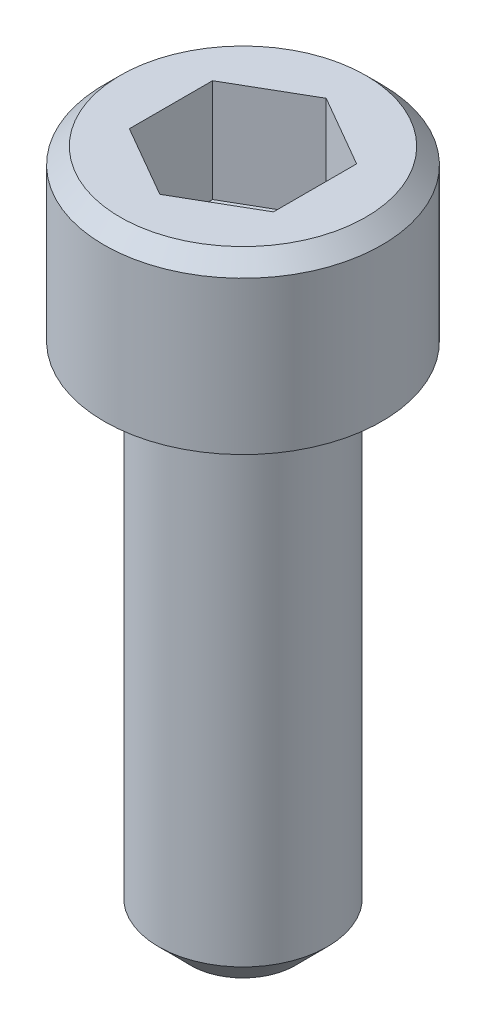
from build123d import *

# Parameters (mm, degrees)
CUT_EXTRUDE1_DEPTH = 2.54


with BuildPart() as part:
    # Sketch1 → Base-Revolve (revolve)
    with BuildSketch(Plane.XY, mode=Mode.PRIVATE) as base_revolve_sk:
        Polygon((0, 0), (3.429, 0), (3.429, 3.768725), (3.032125, 4.1656), (0, 4.1656), align=None)
    revolve(base_revolve_sk.sketch.rotate(Axis((0, 0, 0), (0, 1, 0)), 90), axis=Axis((0, 0, 0), (0, 1, 0)))

    # Sketch2 → Boss-Revolve1 (revolve)
    with BuildSketch(Plane.XY, mode=Mode.PRIVATE) as boss_revolve1_sk:
        Polygon((0, -12.7), (1.290539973, -12.7), (2.0828, -11.904359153), (2.0828, 0), (0, 0), align=None)
    revolve(boss_revolve1_sk.sketch.rotate(Axis((0, 0, 0), (0, 1, 0)), 90), axis=Axis((0, 0, 0), (0, 1, 0)))

    # Sketch3 → Cut-Extrude1 (cut)
    with BuildSketch(Plane(origin=(0, 4.1656, 0), x_dir=(-1, 0, 0), z_dir=(0, 1, 0))):
        Polygon((1.778, 1.026528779), (0, 2.053057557), (-1.778, 1.026528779), (-1.778, -1.026528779), (0, -2.053057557), (1.778, -1.026528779), align=None)
    extrude(amount=-CUT_EXTRUDE1_DEPTH, mode=Mode.SUBTRACT)


solid = part.part
